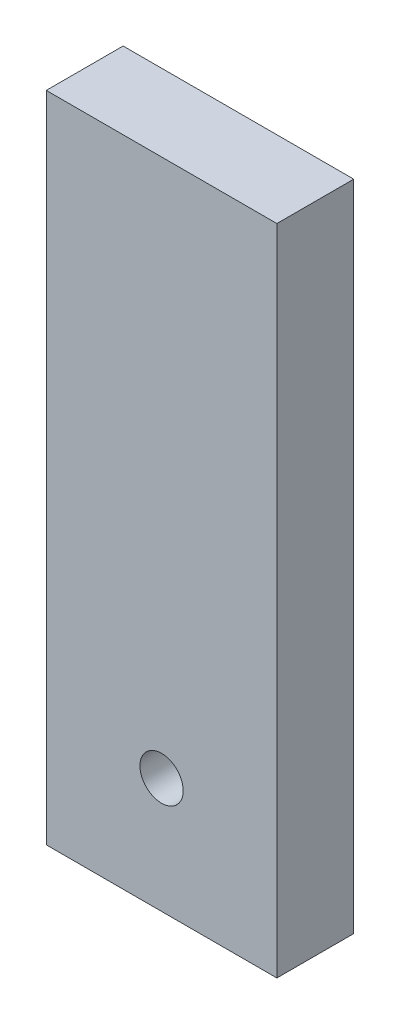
from build123d import *

# Parameters (mm, degrees)
SKETCH1_W                   = 152.4
SKETCH1_H                   = 50.8
BOSS_EXTRUDE1_DEPTH         = 431.8
F_3_4_0_75_DIAMETER_SLOT1_D = 28.575


with BuildPart() as part:
    # Sketch1 → Boss-Extrude1 (new body)
    with BuildSketch(Plane(origin=(0, 0, 0), x_dir=(1, 0, 0), z_dir=(0, 1, 0))):
        with Locations((15.197286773, 0.314565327)):
            Rectangle(SKETCH1_W, SKETCH1_H)
    extrude(amount=BOSS_EXTRUDE1_DEPTH)

    # 3_4 _0.75_ Diameter Slot1 (through all)
    with Locations(Plane.XY.offset(25.085434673)):
        with Locations((15.197286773, 76.2)):
            Hole(F_3_4_0_75_DIAMETER_SLOT1_D / 2)


solid = part.part
